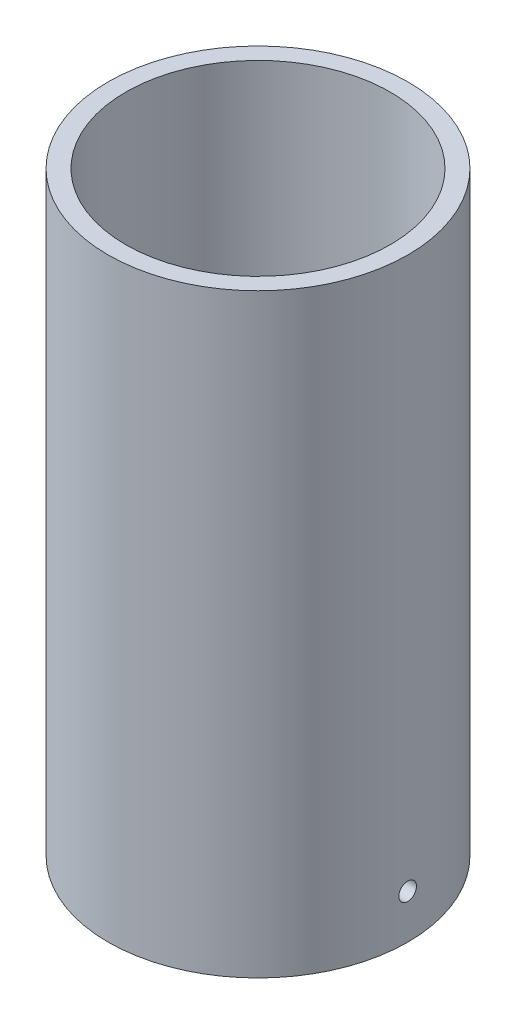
from build123d import *

# Parameters (mm, degrees)
SKETCH1_R                      = 43.18
BOSS_EXTRUDE1_DEPTH            = 171.45
SKETCH2_R                      = 38.1
CUT_EXTRUDE1_DEPTH             = 183.000349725
CUT_EXTRUDE2_REACH             = 198.768
SKETCH3_R                      = 2.54
CUT_EXTRUDE2_DIRECTION_2_DEPTH = 197.768047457


with BuildPart() as part:
    # Sketch1 → Boss-Extrude1 (new body)
    with BuildSketch(Plane(origin=(0, 0, 0), x_dir=(1, 0, 0), z_dir=(0, 1, 0))):
        with Locations(Location((0, 0, 0), (0, 0, 270))):
            Circle(SKETCH1_R)
    extrude(amount=BOSS_EXTRUDE1_DEPTH)

    # Sketch2 → Cut-Extrude1 (cut, through all)
    with BuildSketch(Plane(origin=(0, 171.45, 0), x_dir=(1, 0, 0), z_dir=(0, 1, 0))):
        with Locations(Location((0, 0, 0), (0, 0, 270))):
            Circle(SKETCH2_R)
    extrude(amount=-CUT_EXTRUDE1_DEPTH, mode=Mode.SUBTRACT)

    # Sketch3 → Cut-Extrude2 (cut, up to next)
    with BuildSketch(Plane(origin=(43.18, 0, 0), x_dir=(0, 0, -1), z_dir=(1, 0, 0)), mode=Mode.PRIVATE) as cut_extrude2_sk1:
        with Locations((0, 12.7)):
            Circle(SKETCH3_R)
    cut_extrude2_tool1 = extrude(cut_extrude2_sk1.sketch, amount=-CUT_EXTRUDE2_REACH, mode=Mode.PRIVATE) & part.part
    add(cut_extrude2_tool1.solids().sort_by_distance((43.18, 12.7, 0))[0], mode=Mode.SUBTRACT)

    # Sketch3 → Cut-Extrude2 direction 2 (cut)
    with BuildSketch(Plane(origin=(43.18, 0, 0), x_dir=(0, 0, -1), z_dir=(1, 0, 0))):
        with Locations((0, 12.7)):
            Circle(SKETCH3_R)
    extrude(amount=CUT_EXTRUDE2_DIRECTION_2_DEPTH, mode=Mode.SUBTRACT)


solid = part.part
